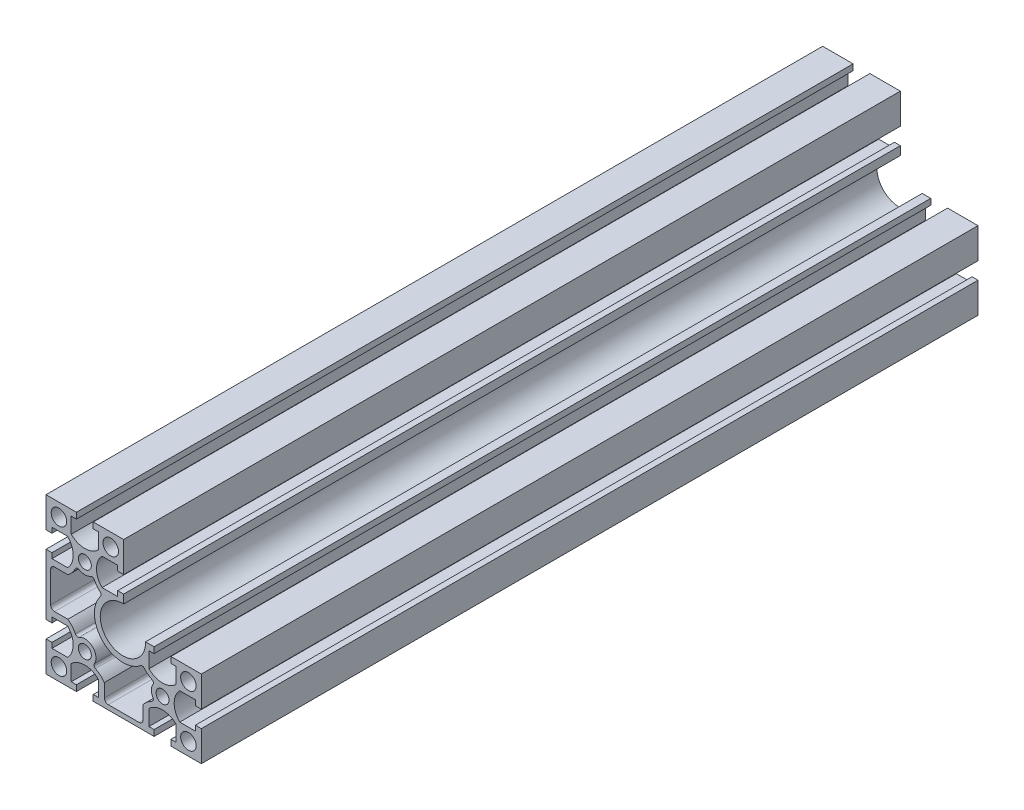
from build123d import *

# Parameters (mm, degrees)
MODEL_R         = 3
MODEL_R_2       = 2.5
EXTRUDE_1_DEPTH = 300


with BuildPart() as part:
    # Model → Extrude 1 (new body)
    with BuildSketch(Plane.XY):
        with BuildLine():
            Line((1995.172977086, 709.807255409), (1995.172977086, 703.751184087))
            ThreePointArc((1995.172977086, 703.751184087), (2000.422977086, 701.607255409), (2005.672977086, 703.751184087))
            Line((2005.672977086, 703.751184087), (2005.672977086, 709.807255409))
            Line((2005.672977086, 709.807255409), (2003.672977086, 709.807255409))
            Line((2003.672977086, 709.807255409), (2003.672977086, 712.107255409))
            Line((2003.672977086, 712.107255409), (2015.422977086, 712.107255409))
            Line((2015.422977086, 712.107255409), (2015.422977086, 700.357255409))
            Line((2015.422977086, 700.357255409), (2013.122977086, 700.357255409))
            Line((2013.122977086, 700.357255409), (2013.122977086, 702.357255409))
            Line((2013.122977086, 702.357255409), (2007.066905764, 702.357255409))
            ThreePointArc((2007.066905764, 702.357255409), (2004.922977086, 697.107255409), (2007.066905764, 691.857255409))
            Line((2007.066905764, 691.857255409), (2013.122977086, 691.857255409))
            Line((2013.122977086, 691.857255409), (2013.122977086, 693.857255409))
            Line((2013.122977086, 693.857255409), (2015.422977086, 693.857255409))
            Line((2015.422977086, 693.857255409), (2015.422977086, 682.107255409))
            Line((2015.422977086, 682.107255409), (2003.672977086, 682.107255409))
            Line((2003.672977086, 682.107255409), (2003.672977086, 684.407255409))
            Line((2003.672977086, 684.407255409), (2005.672977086, 684.407255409))
            Line((2005.672977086, 684.407255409), (2005.672977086, 690.46332673))
            ThreePointArc((2005.672977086, 690.46332673), (2000.422977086, 692.607255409), (1995.172977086, 690.46332673))
            Line((1995.172977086, 690.46332673), (1995.172977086, 684.407255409))
            Line((1995.172977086, 684.407255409), (1997.172977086, 684.407255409))
            Line((1997.172977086, 684.407255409), (1997.172977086, 682.107255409))
            Line((1997.172977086, 682.107255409), (1973.672977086, 682.107255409))
            Line((1973.672977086, 682.107255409), (1973.672977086, 684.407255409))
            Line((1973.672977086, 684.407255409), (1975.672977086, 684.407255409))
            Line((1975.672977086, 684.407255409), (1975.672977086, 690.46332673))
            ThreePointArc((1975.672977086, 690.46332673), (1970.422977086, 692.607255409), (1965.172977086, 690.46332673))
            Line((1965.172977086, 690.46332673), (1965.172977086, 684.407255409))
            Line((1965.172977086, 684.407255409), (1967.172977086, 684.407255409))
            Line((1967.172977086, 684.407255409), (1967.172977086, 682.107255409))
            Line((1967.172977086, 682.107255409), (1955.422977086, 682.107255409))
            Line((1955.422977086, 682.107255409), (1955.422977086, 693.857255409))
            Line((1955.422977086, 693.857255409), (1957.722977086, 693.857255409))
            Line((1957.722977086, 693.857255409), (1957.722977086, 691.857255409))
            Line((1957.722977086, 691.857255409), (1963.779048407, 691.857255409))
            ThreePointArc((1963.779048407, 691.857255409), (1965.922977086, 697.107255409), (1963.779048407, 702.357255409))
            Line((1963.779048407, 702.357255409), (1957.722977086, 702.357255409))
            Line((1957.722977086, 702.357255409), (1957.722977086, 700.357255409))
            Line((1957.722977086, 700.357255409), (1955.422977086, 700.357255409))
            Line((1955.422977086, 700.357255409), (1955.422977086, 723.857255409))
            Line((1955.422977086, 723.857255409), (1957.722977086, 723.857255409))
            Line((1957.722977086, 723.857255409), (1957.722977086, 721.857255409))
            Line((1957.722977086, 721.857255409), (1963.779048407, 721.857255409))
            ThreePointArc((1963.779048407, 721.857255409), (1965.922977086, 727.107255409), (1963.779048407, 732.357255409))
            Line((1963.779048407, 732.357255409), (1957.722977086, 732.357255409))
            Line((1957.722977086, 732.357255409), (1957.722977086, 730.357255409))
            Line((1957.722977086, 730.357255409), (1955.422977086, 730.357255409))
            Line((1955.422977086, 730.357255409), (1955.422977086, 742.107255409))
            Line((1955.422977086, 742.107255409), (1967.172977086, 742.107255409))
            Line((1967.172977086, 742.107255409), (1967.172977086, 739.807255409))
            Line((1967.172977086, 739.807255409), (1965.172977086, 739.807255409))
            Line((1965.172977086, 739.807255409), (1965.172977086, 733.751184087))
            ThreePointArc((1965.172977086, 733.751184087), (1970.422977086, 731.607255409), (1975.672977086, 733.751184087))
            Line((1975.672977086, 733.751184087), (1975.672977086, 739.807255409))
            Line((1975.672977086, 739.807255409), (1973.672977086, 739.807255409))
            Line((1973.672977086, 739.807255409), (1973.672977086, 742.107255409))
            Line((1973.672977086, 742.107255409), (1985.422977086, 742.107255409))
            Line((1985.422977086, 742.107255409), (1985.422977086, 730.357255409))
            Line((1985.422977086, 730.357255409), (1983.122977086, 730.357255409))
            Line((1983.122977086, 730.357255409), (1983.122977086, 732.357255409))
            Line((1983.122977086, 732.357255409), (1977.066905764, 732.357255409))
            ThreePointArc((1977.066905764, 732.357255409), (1974.922977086, 727.107255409), (1977.066905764, 721.857255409))
            Line((1977.066905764, 721.857255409), (1983.122977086, 721.857255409))
            Line((1983.122977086, 721.857255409), (1983.122977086, 723.857255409))
            Line((1983.122977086, 723.857255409), (1985.422977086, 723.857255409))
            Line((1985.422977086, 723.857255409), (1985.422977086, 720.552111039))
            ThreePointArc((1985.422977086, 720.552111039), (1978.93579275, 705.620071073), (1993.867832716, 712.107255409))
            Line((1993.867832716, 712.107255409), (1997.172977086, 712.107255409))
            Line((1997.172977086, 712.107255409), (1997.172977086, 709.807255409))
            Line((1997.172977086, 709.807255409), (1995.172977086, 709.807255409))
        make_face()
        with Locations((1960.422977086, 687.107255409)):
            Circle(MODEL_R, mode=Mode.SUBTRACT)
        with Locations((1970.422977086, 697.107255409)):
            Circle(MODEL_R_2, mode=Mode.SUBTRACT)
        with Locations((1970.422977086, 727.107255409)):
            Circle(MODEL_R_2, mode=Mode.SUBTRACT)
        with Locations((1960.422977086, 737.107255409)):
            Circle(MODEL_R, mode=Mode.SUBTRACT)
        with Locations((1980.422977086, 737.107255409)):
            Circle(MODEL_R, mode=Mode.SUBTRACT)
        with Locations((2010.422977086, 687.107255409)):
            Circle(MODEL_R, mode=Mode.SUBTRACT)
        with Locations((2000.422977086, 697.107255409)):
            Circle(MODEL_R_2, mode=Mode.SUBTRACT)
        with Locations((2010.422977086, 707.107255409)):
            Circle(MODEL_R, mode=Mode.SUBTRACT)
        with BuildLine():
            Line((1963.853216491, 704.657255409), (1958.722977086, 704.657255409))
            ThreePointArc((1958.722977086, 704.657255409), (1957.662316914, 705.096595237), (1957.222977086, 706.157255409))
            Line((1957.222977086, 706.157255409), (1957.222977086, 718.057255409))
            ThreePointArc((1957.222977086, 718.057255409), (1957.662316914, 719.117915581), (1958.722977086, 719.557255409))
            Line((1958.722977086, 719.557255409), (1963.853216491, 719.557255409))
            ThreePointArc((1963.853216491, 719.557255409), (1965.527803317, 721.106301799), (1966.774918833, 723.016403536))
            ThreePointArc((1966.774918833, 723.016403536), (1967.391911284, 723.536215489), (1968.19184501, 723.431381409))
            ThreePointArc((1968.19184501, 723.431381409), (1970.422977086, 722.807255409), (1972.654109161, 723.431381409))
            ThreePointArc((1972.654109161, 723.431381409), (1973.454042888, 723.536215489), (1974.071035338, 723.016403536))
            ThreePointArc((1974.071035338, 723.016403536), (1975.073500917, 721.408553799), (1976.381036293, 720.03725177))
            ThreePointArc((1976.381036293, 720.03725177), (1976.726773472, 719.372757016), (1976.51399956, 718.654554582))
            ThreePointArc((1976.51399956, 718.654554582), (1977.344802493, 704.029080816), (1991.970276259, 703.198277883))
            ThreePointArc((1991.970276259, 703.198277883), (1992.688478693, 703.411051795), (1993.352973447, 703.065314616))
            ThreePointArc((1993.352973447, 703.065314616), (1994.724275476, 701.75777924), (1996.332125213, 700.755313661))
            ThreePointArc((1996.332125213, 700.755313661), (1996.851937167, 700.138321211), (1996.747103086, 699.338387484))
            ThreePointArc((1996.747103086, 699.338387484), (1996.122977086, 697.107255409), (1996.747103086, 694.876123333))
            ThreePointArc((1996.747103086, 694.876123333), (1996.851937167, 694.076189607), (1996.332125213, 693.459197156))
            ThreePointArc((1996.332125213, 693.459197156), (1994.422023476, 692.21208164), (1992.872977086, 690.537494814))
            Line((1992.872977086, 690.537494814), (1992.872977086, 685.407255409))
            ThreePointArc((1992.872977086, 685.407255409), (1992.433637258, 684.346595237), (1991.372977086, 683.907255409))
            Line((1991.372977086, 683.907255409), (1979.472977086, 683.907255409))
            ThreePointArc((1979.472977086, 683.907255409), (1978.412316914, 684.346595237), (1977.972977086, 685.407255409))
            Line((1977.972977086, 685.407255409), (1977.972977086, 690.537494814))
            ThreePointArc((1977.972977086, 690.537494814), (1976.423930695, 692.21208164), (1974.513828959, 693.459197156))
            ThreePointArc((1974.513828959, 693.459197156), (1973.994017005, 694.076189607), (1974.098851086, 694.876123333))
            ThreePointArc((1974.098851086, 694.876123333), (1973.463536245, 700.147814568), (1968.19184501, 700.783129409))
            ThreePointArc((1968.19184501, 700.783129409), (1967.391911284, 700.678295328), (1966.774918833, 701.198107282))
            ThreePointArc((1966.774918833, 701.198107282), (1965.527803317, 703.108209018), (1963.853216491, 704.657255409))
        make_face(mode=Mode.SUBTRACT)
    extrude(amount=EXTRUDE_1_DEPTH)


solid = part.part
